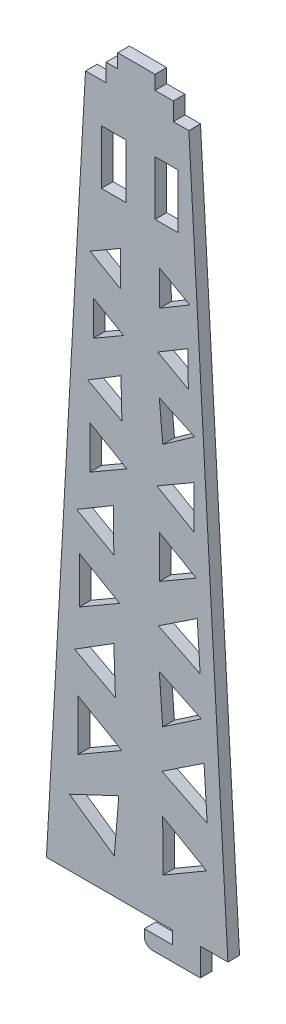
from build123d import *

# Parameters (mm, degrees)
SKETCH1_W           = 6.382856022
SKETCH1_H           = 13.962497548
SKETCH1_W_2         = 5.907920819
BOSS_EXTRUDE1_DEPTH = 3


with BuildPart() as part:
    # Sketch1 → Boss-Extrude1 (new body)
    with BuildSketch(Plane.XY):
        with BuildLine():
            Line((-23.35, 0), (9.05, 0))
            Line((9.05, 0), (9.05, -3.3))
            Line((9.05, -3.3), (1.85, -3.3))
            Line((1.85, -3.3), (1.85, -5.1))
            ThreePointArc((1.85, -5.1), (2.435786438, -6.514213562), (3.85, -7.1))
            Line((3.85, -7.1), (16.25, -7.1))
            Line((16.25, -7.1), (16.25, 0))
            Line((16.25, 0), (23.35, 0))
            Line((23.35, 0), (13.30006339, 180.3))
            Line((13.30006339, 180.3), (9.30006339, 180.3))
            Line((9.30006339, 180.3), (9.30006339, 184.9))
            Line((9.30006339, 184.9), (4.60006339, 184.9))
            Line((4.60006339, 184.9), (4.60006339, 188.5))
            Line((4.60006339, 188.5), (-4.99993661, 188.5))
            Line((-4.99993661, 188.5), (-4.99993661, 184.9))
            Line((-4.99993661, 184.9), (-7.99993661, 184.9))
            Line((-7.99993661, 184.9), (-7.99993661, 180.3))
            Line((-7.99993661, 180.3), (-13.29993661, 180.3))
            Line((-13.29993661, 180.3), (-23.35, 0))
        make_face()
        Polygon((-17.434427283, 17.020231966), (-4.733126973, 23.020934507), (-5.887016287, 9.020934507), align=None, mode=Mode.SUBTRACT)
        Polygon((-15.184739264, 40.020231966), (-3.926409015, 33.520231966), (-15.184739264, 27.020231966), align=None, mode=Mode.SUBTRACT)
        Polygon((-16.099038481, 50.020231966), (-6.012344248, 56.322619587), (-5.59766358, 44.436092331), align=None, mode=Mode.SUBTRACT)
        Polygon((-14.89606413, 72.020231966), (-4.503759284, 66.020231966), (-14.89606413, 60.020231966), align=None, mode=Mode.SUBTRACT)
        Polygon((-15.587201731, 81.436092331), (-6.10950033, 87.020231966), (-6.012344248, 76.020231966), align=None, mode=Mode.SUBTRACT)
        Polygon((6.617947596, 11.031506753), (6.574235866, 24.031433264), (17.854358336, 17.569325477), align=None, mode=Mode.SUBTRACT)
        Polygon((18.027704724, 28.258950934), (6.379595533, 34.031433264), (17.202766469, 41.232750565), align=None, mode=Mode.SUBTRACT)
        Polygon((5.683022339, 55.998293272), (16.492233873, 50.786676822), (6.574235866, 44.031433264), align=None, mode=Mode.SUBTRACT)
        Polygon((5.459733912, 65.998293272), (15.460529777, 72.630342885), (16.203655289, 60.653374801), align=None, mode=Mode.SUBTRACT)
        Polygon((15.209301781, 81.498293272), (5.683022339, 75.998293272), (5.683022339, 86.998293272), align=None, mode=Mode.SUBTRACT)
        Polygon((-12.165209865, 102.436092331), (-2.638930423, 96.936092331), (-12.165209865, 91.436092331), align=None, mode=Mode.SUBTRACT)
        Polygon((-12.709658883, 111.718627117), (-4.176753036, 116.932984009), (-3.927440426, 106.936092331), align=None, mode=Mode.SUBTRACT)
        Polygon((-11.296597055, 130.718627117), (-3.502368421, 126.218627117), (-11.296597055, 121.718627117), align=None, mode=Mode.SUBTRACT)
        Polygon((-12.11721227, 140.729037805), (-4.316977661, 145.218619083), (-4.329003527, 136.218627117), align=None, mode=Mode.SUBTRACT)
        with Locations((-6.028810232, 163.146643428)):
            Rectangle(SKETCH1_W, SKETCH1_H, mode=Mode.SUBTRACT)
        Polygon((14.58733947, 91.498293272), (5.061060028, 96.998293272), (14.58733947, 102.498293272), align=None, mode=Mode.SUBTRACT)
        Polygon((14.767005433, 112.774724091), (6.60411091, 106.998293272), (5.683022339, 116.955782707), align=None, mode=Mode.SUBTRACT)
        Polygon((5.312288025, 126.955489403), (13.046201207, 131.558378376), (13.165463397, 122.559168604), align=None, mode=Mode.SUBTRACT)
        Polygon((13.530843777, 141.548966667), (5.791336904, 136.955489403), (5.683022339, 145.9548376), align=None, mode=Mode.SUBTRACT)
        with Locations((7.554023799, 163.146643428)):
            Rectangle(SKETCH1_W_2, SKETCH1_H, mode=Mode.SUBTRACT)
    extrude(amount=BOSS_EXTRUDE1_DEPTH)


solid = part.part
